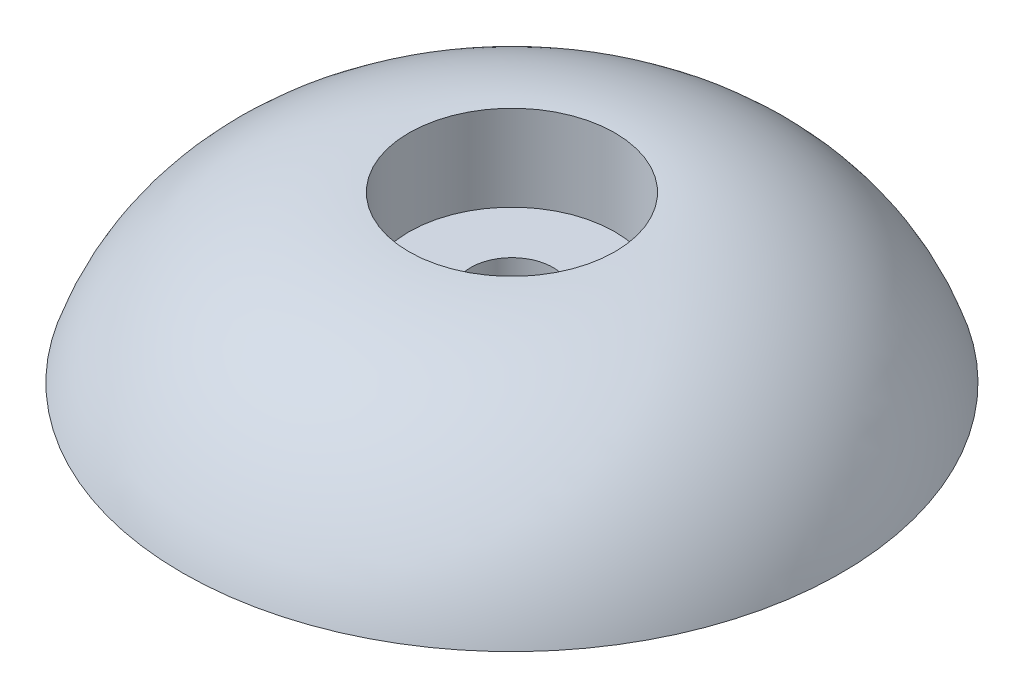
ISO-10303-21;
HEADER;
FILE_DESCRIPTION(('STEP AP214'),'2;1');
FILE_NAME('part.step','',(''),(''),'','','');
FILE_SCHEMA(('AUTOMOTIVE_DESIGN { 1 0 10303 214 1 1 1 1 }'));
ENDSEC;
DATA;
#1=APPLICATION_CONTEXT('core data for automotive mechanical design processes');
#2=APPLICATION_PROTOCOL_DEFINITION('international standard','automotive_design',2000,#1);
#3=PRODUCT_CONTEXT('',#1,'mechanical');
#4=PRODUCT('Part','Part','',(#3));
#5=PRODUCT_RELATED_PRODUCT_CATEGORY('part','',(#4));
#6=PRODUCT_DEFINITION_FORMATION('','',#4);
#7=PRODUCT_DEFINITION_CONTEXT('part definition',#1,'design');
#8=PRODUCT_DEFINITION('design','',#6,#7);
#9=PRODUCT_DEFINITION_SHAPE('','',#8);
#10=(LENGTH_UNIT() NAMED_UNIT(*) SI_UNIT(.MILLI.,.METRE.));
#11=(NAMED_UNIT(*) PLANE_ANGLE_UNIT() SI_UNIT($,.RADIAN.));
#12=(NAMED_UNIT(*) SI_UNIT($,.STERADIAN.) SOLID_ANGLE_UNIT());
#13=UNCERTAINTY_MEASURE_WITH_UNIT(LENGTH_MEASURE(1.E-05),#10,'distance_accuracy_value','');
#14=(GEOMETRIC_REPRESENTATION_CONTEXT(3) GLOBAL_UNCERTAINTY_ASSIGNED_CONTEXT((#13)) GLOBAL_UNIT_ASSIGNED_CONTEXT((#10,
#11,#12)) REPRESENTATION_CONTEXT('',''));
#15=CARTESIAN_POINT('',(0.,0.,0.));
#16=DIRECTION('',(0.,0.,1.));
#17=DIRECTION('',(1.,0.,0.));
#18=AXIS2_PLACEMENT_3D('',#15,#16,#17);
#19=CARTESIAN_POINT('',(0.,0.,-50.8));
#20=DIRECTION('',(0.,1.,0.));
#21=DIRECTION('',(0.,0.,1.));
#22=AXIS2_PLACEMENT_3D('',#19,#20,#21);
#23=PLANE('',#22);
#24=CARTESIAN_POINT('',(0.,0.,0.));
#25=DIRECTION('',(0.,1.,0.));
#26=DIRECTION('',(0.,0.,1.));
#27=AXIS2_PLACEMENT_3D('',#24,#25,#26);
#28=CIRCLE('',#27,50.8);
#29=CARTESIAN_POINT('',(0.,0.,50.8));
#30=VERTEX_POINT('',#29);
#31=EDGE_CURVE('E52',#30,#30,#28,.T.);
#32=ORIENTED_EDGE('',*,*,#31,.F.);
#33=EDGE_LOOP('',(#32));
#34=FACE_BOUND('',#33,.T.);
#35=CARTESIAN_POINT('',(0.,0.,0.));
#36=DIRECTION('',(0.,1.,0.));
#37=DIRECTION('',(0.,0.,1.));
#38=AXIS2_PLACEMENT_3D('',#35,#36,#37);
#39=CIRCLE('',#38,6.35);
#40=CARTESIAN_POINT('',(0.,0.,6.35));
#41=VERTEX_POINT('',#40);
#42=EDGE_CURVE('E10',#41,#41,#39,.T.);
#43=ORIENTED_EDGE('',*,*,#42,.T.);
#44=EDGE_LOOP('',(#43));
#45=FACE_BOUND('',#44,.T.);
#46=ADVANCED_FACE('F33',(#34,#45),#23,.F.);
#47=CARTESIAN_POINT('',(0.,0.,0.));
#48=DIRECTION('',(0.,1.,0.));
#49=DIRECTION('',(0.,0.,1.));
#50=AXIS2_PLACEMENT_3D('',#47,#48,#49);
#51=CYLINDRICAL_SURFACE('',#50,6.35);
#52=ORIENTED_EDGE('',*,*,#42,.F.);
#53=EDGE_LOOP('',(#52));
#54=FACE_BOUND('',#53,.T.);
#55=CARTESIAN_POINT('',(0.,12.192,0.));
#56=DIRECTION('',(0.,1.,0.));
#57=DIRECTION('',(0.,0.,1.));
#58=AXIS2_PLACEMENT_3D('',#55,#56,#57);
#59=CIRCLE('',#58,6.35);
#60=CARTESIAN_POINT('',(0.,12.192,6.35));
#61=VERTEX_POINT('',#60);
#62=EDGE_CURVE('E39',#61,#61,#59,.T.);
#63=ORIENTED_EDGE('',*,*,#62,.T.);
#64=EDGE_LOOP('',(#63));
#65=FACE_BOUND('',#64,.T.);
#66=ADVANCED_FACE('F59',(#54,#65),#51,.F.);
#67=CARTESIAN_POINT('',(0.,12.192,-6.35));
#68=DIRECTION('',(0.,-1.,0.));
#69=DIRECTION('',(0.,0.,-1.));
#70=AXIS2_PLACEMENT_3D('',#67,#68,#69);
#71=PLANE('',#70);
#72=ORIENTED_EDGE('',*,*,#62,.F.);
#73=EDGE_LOOP('',(#72));
#74=FACE_BOUND('',#73,.T.);
#75=CARTESIAN_POINT('',(0.,12.192,0.));
#76=DIRECTION('',(0.,1.,0.));
#77=DIRECTION('',(0.,0.,1.));
#78=AXIS2_PLACEMENT_3D('',#75,#76,#77);
#79=CIRCLE('',#78,15.875);
#80=CARTESIAN_POINT('',(0.,12.192,15.875));
#81=VERTEX_POINT('',#80);
#82=EDGE_CURVE('E43',#81,#81,#79,.T.);
#83=ORIENTED_EDGE('',*,*,#82,.T.);
#84=EDGE_LOOP('',(#83));
#85=FACE_BOUND('',#84,.T.);
#86=ADVANCED_FACE('F63',(#74,#85),#71,.F.);
#87=CARTESIAN_POINT('',(0.,0.,0.));
#88=DIRECTION('',(0.,1.,0.));
#89=DIRECTION('',(0.,0.,1.));
#90=AXIS2_PLACEMENT_3D('',#87,#88,#89);
#91=CYLINDRICAL_SURFACE('',#90,15.875);
#92=ORIENTED_EDGE('',*,*,#82,.F.);
#93=EDGE_LOOP('',(#92));
#94=FACE_BOUND('',#93,.T.);
#95=CARTESIAN_POINT('',(0.,25.4,0.));
#96=DIRECTION('',(0.,1.,0.));
#97=DIRECTION('',(0.,0.,1.));
#98=AXIS2_PLACEMENT_3D('',#95,#96,#97);
#99=CIRCLE('',#98,15.875);
#100=CARTESIAN_POINT('',(0.,25.4,15.875));
#101=VERTEX_POINT('',#100);
#102=EDGE_CURVE('E47',#101,#101,#99,.T.);
#103=ORIENTED_EDGE('',*,*,#102,.T.);
#104=EDGE_LOOP('',(#103));
#105=FACE_BOUND('',#104,.T.);
#106=ADVANCED_FACE('F68',(#94,#105),#91,.F.);
#107=CARTESIAN_POINT('',(0.,-11.3109375,0.));
#108=DIRECTION('',(0.,1.,0.));
#109=DIRECTION('',(0.,0.,1.));
#110=AXIS2_PLACEMENT_3D('',#107,#108,#109);
#111=DEGENERATE_TOROIDAL_SURFACE('',#110,15.875,36.7109375,.T.);
#112=ORIENTED_EDGE('',*,*,#102,.F.);
#113=EDGE_LOOP('',(#112));
#114=FACE_BOUND('',#113,.T.);
#115=ORIENTED_EDGE('',*,*,#31,.T.);
#116=EDGE_LOOP('',(#115));
#117=FACE_BOUND('',#116,.T.);
#118=ADVANCED_FACE('F56',(#114,#117),#111,.T.);
#119=CLOSED_SHELL('',(#46,#66,#86,#106,#118));
#120=MANIFOLD_SOLID_BREP('B2',#119);
#121=ADVANCED_BREP_SHAPE_REPRESENTATION('',(#18,#120),#14);
#122=SHAPE_DEFINITION_REPRESENTATION(#9,#121);
ENDSEC;
END-ISO-10303-21;
